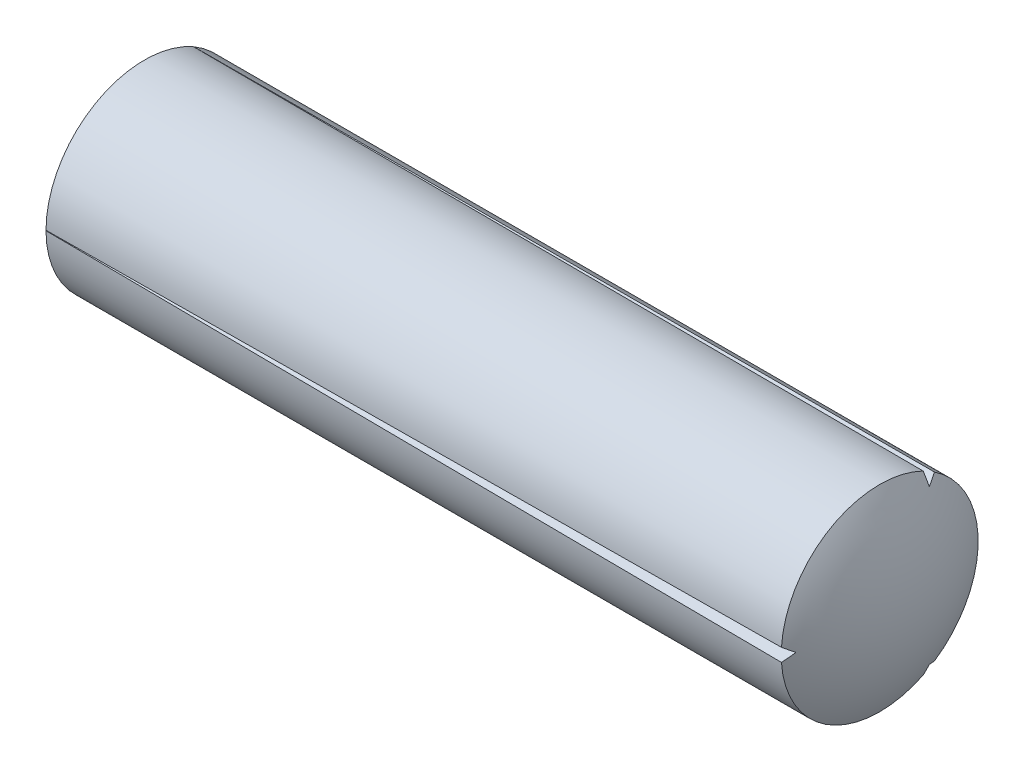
ISO-10303-21;
HEADER;
FILE_DESCRIPTION(('STEP AP214'),'2;1');
FILE_NAME('part.step','',(''),(''),'','','');
FILE_SCHEMA(('AUTOMOTIVE_DESIGN { 1 0 10303 214 1 1 1 1 }'));
ENDSEC;
DATA;
#1=APPLICATION_CONTEXT('core data for automotive mechanical design processes');
#2=APPLICATION_PROTOCOL_DEFINITION('international standard','automotive_design',2000,#1);
#3=PRODUCT_CONTEXT('',#1,'mechanical');
#4=PRODUCT('Part','Part','',(#3));
#5=PRODUCT_RELATED_PRODUCT_CATEGORY('part','',(#4));
#6=PRODUCT_DEFINITION_FORMATION('','',#4);
#7=PRODUCT_DEFINITION_CONTEXT('part definition',#1,'design');
#8=PRODUCT_DEFINITION('design','',#6,#7);
#9=PRODUCT_DEFINITION_SHAPE('','',#8);
#10=(LENGTH_UNIT() NAMED_UNIT(*) SI_UNIT(.MILLI.,.METRE.));
#11=(NAMED_UNIT(*) PLANE_ANGLE_UNIT() SI_UNIT($,.RADIAN.));
#12=(NAMED_UNIT(*) SI_UNIT($,.STERADIAN.) SOLID_ANGLE_UNIT());
#13=UNCERTAINTY_MEASURE_WITH_UNIT(LENGTH_MEASURE(1.E-05),#10,'distance_accuracy_value','');
#14=(GEOMETRIC_REPRESENTATION_CONTEXT(3) GLOBAL_UNCERTAINTY_ASSIGNED_CONTEXT((#13)) GLOBAL_UNIT_ASSIGNED_CONTEXT((#10,
#11,#12)) REPRESENTATION_CONTEXT('',''));
#15=CARTESIAN_POINT('',(0.,0.,0.));
#16=DIRECTION('',(0.,0.,1.));
#17=DIRECTION('',(1.,0.,0.));
#18=AXIS2_PLACEMENT_3D('',#15,#16,#17);
#19=CARTESIAN_POINT('',(-40.,0.,0.));
#20=DIRECTION('',(-1.,0.,0.));
#21=DIRECTION('',(0.,0.,1.));
#22=AXIS2_PLACEMENT_3D('',#19,#20,#21);
#23=CYLINDRICAL_SURFACE('',#22,12.5);
#24=CARTESIAN_POINT('',(-3.34936490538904,0.,0.));
#25=DIRECTION('',(-1.,0.,0.));
#26=DIRECTION('',(0.,0.,1.));
#27=AXIS2_PLACEMENT_3D('',#24,#25,#26);
#28=CIRCLE('',#27,12.5);
#29=CARTESIAN_POINT('',(-3.34936490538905,0.826777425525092,12.4726275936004));
#30=VERTEX_POINT('',#29);
#31=CARTESIAN_POINT('',(-3.34936490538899,11.2150010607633,-5.52030354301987));
#32=VERTEX_POINT('',#31);
#33=EDGE_CURVE('E129',#30,#32,#28,.T.);
#34=ORIENTED_EDGE('',*,*,#33,.T.);
#35=CARTESIAN_POINT('',(900.,0.,0.));
#36=DIRECTION('',(-0.00716952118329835,-0.0871535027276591,0.996169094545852));
#37=DIRECTION('',(-0.999974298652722,0.000624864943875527,-0.00714223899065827));
#38=AXIS2_PLACEMENT_3D('',#35,#36,#37);
#39=ELLIPSE('',#38,1743.49160570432,12.5);
#40=CARTESIAN_POINT('',(-96.6819046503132,10.8397975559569,-6.22485252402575));
#41=VERTEX_POINT('',#40);
#42=EDGE_CURVE('E166',#32,#41,#39,.T.);
#43=ORIENTED_EDGE('',*,*,#42,.T.);
#44=CARTESIAN_POINT('',(-96.6819046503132,0.,0.));
#45=DIRECTION('',(-1.,0.,0.));
#46=DIRECTION('',(0.,0.,1.));
#47=AXIS2_PLACEMENT_3D('',#44,#45,#46);
#48=CIRCLE('',#47,12.5);
#49=CARTESIAN_POINT('',(-96.6819046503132,0.0290183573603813,12.4999663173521));
#50=VERTEX_POINT('',#49);
#51=EDGE_CURVE('E118',#50,#41,#48,.T.);
#52=ORIENTED_EDGE('',*,*,#51,.F.);
#53=CARTESIAN_POINT('',(899.999999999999,0.,0.));
#54=DIRECTION('',(-0.00716952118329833,0.819130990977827,-0.573561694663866));
#55=DIRECTION('',(-0.999974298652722,-0.00587292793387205,0.0041122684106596));
#56=AXIS2_PLACEMENT_3D('',#53,#54,#55);
#57=ELLIPSE('',#56,1743.49160570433,12.5);
#58=EDGE_CURVE('E147',#50,#30,#57,.T.);
#59=ORIENTED_EDGE('',*,*,#58,.T.);
#60=EDGE_LOOP('',(#34,#43,#52,#59));
#61=FACE_BOUND('',#60,.T.);
#62=ADVANCED_FACE('F32',(#61),#23,.T.);
#63=CARTESIAN_POINT('',(-96.6819046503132,10.8107791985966,-6.27511379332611));
#64=VERTEX_POINT('',#63);
#65=CARTESIAN_POINT('',(-96.6819046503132,-10.8107791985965,-6.27511379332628));
#66=VERTEX_POINT('',#65);
#67=EDGE_CURVE('E124',#64,#66,#48,.T.);
#68=ORIENTED_EDGE('',*,*,#67,.F.);
#69=CARTESIAN_POINT('',(899.999999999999,0.,0.));
#70=DIRECTION('',(-0.00716952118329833,-0.906284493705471,-0.422607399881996));
#71=DIRECTION('',(-0.999974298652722,0.00649779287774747,0.00302997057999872));
#72=AXIS2_PLACEMENT_3D('',#69,#70,#71);
#73=ELLIPSE('',#72,1743.49160570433,12.5);
#74=CARTESIAN_POINT('',(-3.3493649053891,10.3882236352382,-6.95232405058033));
#75=VERTEX_POINT('',#74);
#76=EDGE_CURVE('E47',#64,#75,#73,.T.);
#77=ORIENTED_EDGE('',*,*,#76,.T.);
#78=CARTESIAN_POINT('',(-3.34936490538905,-10.3882236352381,-6.95232405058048));
#79=VERTEX_POINT('',#78);
#80=EDGE_CURVE('E127',#75,#79,#28,.T.);
#81=ORIENTED_EDGE('',*,*,#80,.T.);
#82=CARTESIAN_POINT('',(900.,0.,0.));
#83=DIRECTION('',(-0.00716952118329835,0.906284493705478,-0.422607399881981));
#84=DIRECTION('',(-0.999974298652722,-0.00649779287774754,0.00302997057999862));
#85=AXIS2_PLACEMENT_3D('',#82,#83,#84);
#86=ELLIPSE('',#85,1743.49160570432,12.5);
#87=EDGE_CURVE('E155',#79,#66,#86,.T.);
#88=ORIENTED_EDGE('',*,*,#87,.T.);
#89=EDGE_LOOP('',(#68,#77,#81,#88));
#90=FACE_BOUND('',#89,.T.);
#91=ADVANCED_FACE('F172',(#90),#23,.T.);
#92=CARTESIAN_POINT('',(-25.,0.,0.));
#93=DIRECTION('',(-1.,0.,0.));
#94=DIRECTION('',(0.,1.,0.));
#95=AXIS2_PLACEMENT_3D('',#92,#93,#94);
#96=SPHERICAL_SURFACE('',#95,25.);
#97=CARTESIAN_POINT('',(-24.9524531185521,6.01030393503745,2.80265075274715));
#98=DIRECTION('',(-0.00716952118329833,-0.906284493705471,-0.422607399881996));
#99=DIRECTION('',(0.,0.422618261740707,-0.906307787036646));
#100=AXIS2_PLACEMENT_3D('',#97,#98,#99);
#101=CIRCLE('',#100,24.1043385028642);
#102=CARTESIAN_POINT('',(-2.69126967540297,9.77191964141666,-5.64182043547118));
#103=VERTEX_POINT('',#102);
#104=EDGE_CURVE('E168',#75,#103,#101,.T.);
#105=ORIENTED_EDGE('',*,*,#104,.T.);
#106=CARTESIAN_POINT('',(-24.9524531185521,0.577985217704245,-6.60640126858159));
#107=DIRECTION('',(-0.00716952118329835,-0.0871535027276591,0.996169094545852));
#108=DIRECTION('',(0.,-0.996194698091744,-0.0871557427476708));
#109=AXIS2_PLACEMENT_3D('',#106,#107,#108);
#110=CIRCLE('',#109,24.1043385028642);
#111=EDGE_CURVE('E112',#103,#32,#110,.T.);
#112=ORIENTED_EDGE('',*,*,#111,.T.);
#113=ORIENTED_EDGE('',*,*,#33,.F.);
#114=CARTESIAN_POINT('',(-24.9524531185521,-5.43231871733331,3.80375051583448));
#115=DIRECTION('',(-0.00716952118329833,0.819130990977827,-0.573561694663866));
#116=DIRECTION('',(0.,0.573576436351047,0.819152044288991));
#117=AXIS2_PLACEMENT_3D('',#114,#115,#116);
#118=CIRCLE('',#117,24.1043385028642);
#119=CARTESIAN_POINT('',(-2.69126967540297,0.,11.2836408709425));
#120=VERTEX_POINT('',#119);
#121=EDGE_CURVE('E144',#30,#120,#118,.T.);
#122=ORIENTED_EDGE('',*,*,#121,.T.);
#123=CARTESIAN_POINT('',(-24.9524531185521,5.4323187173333,3.80375051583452));
#124=DIRECTION('',(-0.00716952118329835,-0.819130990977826,-0.573561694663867));
#125=DIRECTION('',(0.,0.573576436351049,-0.81915204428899));
#126=AXIS2_PLACEMENT_3D('',#123,#124,#125);
#127=CIRCLE('',#126,24.1043385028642);
#128=CARTESIAN_POINT('',(-3.34936490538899,-0.826777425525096,12.4726275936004));
#129=VERTEX_POINT('',#128);
#130=EDGE_CURVE('E135',#120,#129,#127,.T.);
#131=ORIENTED_EDGE('',*,*,#130,.T.);
#132=CARTESIAN_POINT('',(-3.34936490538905,-11.2150010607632,-5.52030354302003));
#133=VERTEX_POINT('',#132);
#134=EDGE_CURVE('E123',#133,#129,#28,.T.);
#135=ORIENTED_EDGE('',*,*,#134,.F.);
#136=CARTESIAN_POINT('',(-24.9524531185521,-0.57798521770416,-6.60640126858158));
#137=DIRECTION('',(-0.00716952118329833,0.087153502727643,0.996169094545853));
#138=DIRECTION('',(0.,-0.996194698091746,0.0871557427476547));
#139=AXIS2_PLACEMENT_3D('',#136,#137,#138);
#140=CIRCLE('',#139,24.1043385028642);
#141=CARTESIAN_POINT('',(-2.69126967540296,-9.77191964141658,-5.64182043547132));
#142=VERTEX_POINT('',#141);
#143=EDGE_CURVE('E158',#133,#142,#140,.T.);
#144=ORIENTED_EDGE('',*,*,#143,.T.);
#145=CARTESIAN_POINT('',(-24.9524531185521,-6.01030393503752,2.80265075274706));
#146=DIRECTION('',(-0.00716952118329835,0.906284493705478,-0.422607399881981));
#147=DIRECTION('',(0.,0.422618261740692,0.906307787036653));
#148=AXIS2_PLACEMENT_3D('',#145,#146,#147);
#149=CIRCLE('',#148,24.1043385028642);
#150=EDGE_CURVE('E152',#142,#79,#149,.T.);
#151=ORIENTED_EDGE('',*,*,#150,.T.);
#152=ORIENTED_EDGE('',*,*,#80,.F.);
#153=EDGE_LOOP('',(#105,#112,#113,#122,#131,#135,#144,#151,#152));
#154=FACE_BOUND('',#153,.T.);
#155=ADVANCED_FACE('F34',(#154),#96,.T.);
#156=CARTESIAN_POINT('',(-96.6819046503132,-10.8397975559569,-6.2248525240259));
#157=VERTEX_POINT('',#156);
#158=CARTESIAN_POINT('',(-96.6819046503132,-0.0290183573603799,12.4999663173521));
#159=VERTEX_POINT('',#158);
#160=EDGE_CURVE('E126',#157,#159,#48,.T.);
#161=ORIENTED_EDGE('',*,*,#160,.F.);
#162=CARTESIAN_POINT('',(899.999999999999,0.,0.));
#163=DIRECTION('',(-0.00716952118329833,0.087153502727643,0.996169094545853));
#164=DIRECTION('',(-0.999974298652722,-0.00062486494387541,-0.00714223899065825));
#165=AXIS2_PLACEMENT_3D('',#162,#163,#164);
#166=ELLIPSE('',#165,1743.49160570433,12.5);
#167=EDGE_CURVE('E55',#157,#133,#166,.T.);
#168=ORIENTED_EDGE('',*,*,#167,.T.);
#169=ORIENTED_EDGE('',*,*,#134,.T.);
#170=CARTESIAN_POINT('',(899.999999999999,0.,0.));
#171=DIRECTION('',(-0.00716952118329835,-0.819130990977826,-0.573561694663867));
#172=DIRECTION('',(-0.999974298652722,0.00587292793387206,0.00411226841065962));
#173=AXIS2_PLACEMENT_3D('',#170,#171,#172);
#174=ELLIPSE('',#173,1743.49160570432,12.5);
#175=EDGE_CURVE('E139',#129,#159,#174,.T.);
#176=ORIENTED_EDGE('',*,*,#175,.T.);
#177=EDGE_LOOP('',(#161,#168,#169,#176));
#178=FACE_BOUND('',#177,.T.);
#179=ADVANCED_FACE('F191',(#178),#23,.T.);
#180=CARTESIAN_POINT('',(-75.0312695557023,0.,0.));
#181=DIRECTION('',(-1.,0.,0.));
#182=DIRECTION('',(0.,1.,0.));
#183=AXIS2_PLACEMENT_3D('',#180,#181,#182);
#184=SPHERICAL_SURFACE('',#183,25.);
#185=CARTESIAN_POINT('',(-100.,0.,0.));
#186=DIRECTION('',(-1.,0.,0.));
#187=DIRECTION('',(0.,0.,1.));
#188=AXIS2_PLACEMENT_3D('',#185,#186,#187);
#189=CIRCLE('',#188,1.25);
#190=CARTESIAN_POINT('',(-100.,0.,1.25));
#191=VERTEX_POINT('',#190);
#192=EDGE_CURVE('E131',#191,#191,#189,.T.);
#193=ORIENTED_EDGE('',*,*,#192,.F.);
#194=EDGE_LOOP('',(#193));
#195=FACE_BOUND('',#194,.T.);
#196=ORIENTED_EDGE('',*,*,#51,.T.);
#197=CARTESIAN_POINT('',(-74.9811509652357,0.609247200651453,-6.96372736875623));
#198=DIRECTION('',(-0.00716952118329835,-0.0871535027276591,0.996169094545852));
#199=DIRECTION('',(0.,-0.996194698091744,-0.0871557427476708));
#200=AXIS2_PLACEMENT_3D('',#197,#198,#199);
#201=CIRCLE('',#200,24.002766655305);
#202=CARTESIAN_POINT('',(-96.7056275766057,10.7896549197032,-6.22941017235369));
#203=VERTEX_POINT('',#202);
#204=EDGE_CURVE('E11',#41,#203,#201,.T.);
#205=ORIENTED_EDGE('',*,*,#204,.T.);
#206=CARTESIAN_POINT('',(-74.9811509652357,6.33538840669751,2.95424013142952));
#207=DIRECTION('',(-0.00716952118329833,-0.906284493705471,-0.422607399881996));
#208=DIRECTION('',(0.,0.422618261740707,-0.906307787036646));
#209=AXIS2_PLACEMENT_3D('',#206,#207,#208);
#210=CIRCLE('',#209,24.002766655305);
#211=EDGE_CURVE('E40',#203,#64,#210,.T.);
#212=ORIENTED_EDGE('',*,*,#211,.T.);
#213=ORIENTED_EDGE('',*,*,#67,.T.);
#214=CARTESIAN_POINT('',(-74.9811509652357,-6.33538840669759,2.95424013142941));
#215=DIRECTION('',(-0.00716952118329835,0.906284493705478,-0.422607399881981));
#216=DIRECTION('',(0.,0.422618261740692,0.906307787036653));
#217=AXIS2_PLACEMENT_3D('',#214,#215,#216);
#218=CIRCLE('',#217,24.002766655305);
#219=CARTESIAN_POINT('',(-96.7056275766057,-10.7896549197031,-6.22941017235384));
#220=VERTEX_POINT('',#219);
#221=EDGE_CURVE('E107',#66,#220,#218,.T.);
#222=ORIENTED_EDGE('',*,*,#221,.T.);
#223=CARTESIAN_POINT('',(-74.9811509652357,-0.609247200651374,-6.96372736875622));
#224=DIRECTION('',(-0.00716952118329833,0.087153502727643,0.996169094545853));
#225=DIRECTION('',(0.,-0.996194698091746,0.0871557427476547));
#226=AXIS2_PLACEMENT_3D('',#223,#224,#225);
#227=CIRCLE('',#226,24.002766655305);
#228=EDGE_CURVE('E180',#220,#157,#227,.T.);
#229=ORIENTED_EDGE('',*,*,#228,.T.);
#230=ORIENTED_EDGE('',*,*,#160,.T.);
#231=CARTESIAN_POINT('',(-74.9811509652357,5.72614120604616,4.0094872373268));
#232=DIRECTION('',(-0.00716952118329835,-0.819130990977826,-0.573561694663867));
#233=DIRECTION('',(0.,0.573576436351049,-0.81915204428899));
#234=AXIS2_PLACEMENT_3D('',#231,#232,#233);
#235=CIRCLE('',#234,24.002766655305);
#236=CARTESIAN_POINT('',(-96.7056275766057,0.,12.4588203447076));
#237=VERTEX_POINT('',#236);
#238=EDGE_CURVE('E178',#159,#237,#235,.T.);
#239=ORIENTED_EDGE('',*,*,#238,.T.);
#240=CARTESIAN_POINT('',(-74.9811509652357,-5.72614120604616,4.00948723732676));
#241=DIRECTION('',(-0.00716952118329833,0.819130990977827,-0.573561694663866));
#242=DIRECTION('',(0.,0.573576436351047,0.819152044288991));
#243=AXIS2_PLACEMENT_3D('',#240,#241,#242);
#244=CIRCLE('',#243,24.002766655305);
#245=EDGE_CURVE('E120',#237,#50,#244,.T.);
#246=ORIENTED_EDGE('',*,*,#245,.T.);
#247=EDGE_LOOP('',(#196,#205,#212,#213,#222,#229,#230,#239,#246));
#248=FACE_BOUND('',#247,.T.);
#249=ADVANCED_FACE('F115',(#195,#248),#184,.T.);
#250=CARTESIAN_POINT('',(-100.,0.,0.));
#251=DIRECTION('',(1.,0.,0.));
#252=DIRECTION('',(0.,0.,-1.));
#253=AXIS2_PLACEMENT_3D('',#250,#251,#252);
#254=PLANE('',#253);
#255=ORIENTED_EDGE('',*,*,#192,.T.);
#256=EDGE_LOOP('',(#255));
#257=FACE_BOUND('',#256,.T.);
#258=ADVANCED_FACE('F208',(#257),#254,.F.);
#259=CARTESIAN_POINT('',(-100.,0.,12.5));
#260=DIRECTION('',(-0.00716952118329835,-0.819130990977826,-0.573561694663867));
#261=DIRECTION('',(0.,0.573576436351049,-0.81915204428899));
#262=AXIS2_PLACEMENT_3D('',#259,#260,#261);
#263=PLANE('',#262);
#264=DIRECTION('',(0.999921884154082,0.,-0.012499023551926));
#265=VECTOR('',#264,1.);
#266=CARTESIAN_POINT('',(-100.,0.,12.5));
#267=LINE('',#266,#265);
#268=EDGE_CURVE('E149',#237,#120,#267,.T.);
#269=ORIENTED_EDGE('',*,*,#268,.F.);
#270=ORIENTED_EDGE('',*,*,#238,.F.);
#271=ORIENTED_EDGE('',*,*,#175,.F.);
#272=ORIENTED_EDGE('',*,*,#130,.F.);
#273=EDGE_LOOP('',(#269,#270,#271,#272));
#274=FACE_BOUND('',#273,.T.);
#275=ADVANCED_FACE('F194',(#274),#263,.F.);
#276=CARTESIAN_POINT('',(-100.,0.,12.5));
#277=DIRECTION('',(-0.00716952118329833,0.819130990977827,-0.573561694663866));
#278=DIRECTION('',(0.,0.573576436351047,0.819152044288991));
#279=AXIS2_PLACEMENT_3D('',#276,#277,#278);
#280=PLANE('',#279);
#281=ORIENTED_EDGE('',*,*,#58,.F.);
#282=ORIENTED_EDGE('',*,*,#245,.F.);
#283=ORIENTED_EDGE('',*,*,#268,.T.);
#284=ORIENTED_EDGE('',*,*,#121,.F.);
#285=EDGE_LOOP('',(#281,#282,#283,#284));
#286=FACE_BOUND('',#285,.T.);
#287=ADVANCED_FACE('F196',(#286),#280,.F.);
#288=CARTESIAN_POINT('',(-100.,-10.8253175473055,-6.25000000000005));
#289=DIRECTION('',(-0.00716952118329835,0.906284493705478,-0.422607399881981));
#290=DIRECTION('',(0.,0.422618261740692,0.906307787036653));
#291=AXIS2_PLACEMENT_3D('',#288,#289,#290);
#292=PLANE('',#291);
#293=DIRECTION('',(0.999921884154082,0.0108244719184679,0.00624951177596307));
#294=VECTOR('',#293,1.);
#295=CARTESIAN_POINT('',(-100.,-10.8253175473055,-6.25000000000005));
#296=LINE('',#295,#294);
#297=EDGE_CURVE('E162',#220,#142,#296,.T.);
#298=ORIENTED_EDGE('',*,*,#297,.F.);
#299=ORIENTED_EDGE('',*,*,#221,.F.);
#300=ORIENTED_EDGE('',*,*,#87,.F.);
#301=ORIENTED_EDGE('',*,*,#150,.F.);
#302=EDGE_LOOP('',(#298,#299,#300,#301));
#303=FACE_BOUND('',#302,.T.);
#304=ADVANCED_FACE('F186',(#303),#292,.F.);
#305=CARTESIAN_POINT('',(-100.,-10.8253175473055,-6.25000000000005));
#306=DIRECTION('',(-0.00716952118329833,0.087153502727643,0.996169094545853));
#307=DIRECTION('',(0.,-0.996194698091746,0.0871557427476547));
#308=AXIS2_PLACEMENT_3D('',#305,#306,#307);
#309=PLANE('',#308);
#310=ORIENTED_EDGE('',*,*,#167,.F.);
#311=ORIENTED_EDGE('',*,*,#228,.F.);
#312=ORIENTED_EDGE('',*,*,#297,.T.);
#313=ORIENTED_EDGE('',*,*,#143,.F.);
#314=EDGE_LOOP('',(#310,#311,#312,#313));
#315=FACE_BOUND('',#314,.T.);
#316=ADVANCED_FACE('F187',(#315),#309,.F.);
#317=CARTESIAN_POINT('',(-100.,10.8253175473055,-6.2499999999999));
#318=DIRECTION('',(-0.00716952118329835,-0.0871535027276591,0.996169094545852));
#319=DIRECTION('',(0.,-0.996194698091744,-0.0871557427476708));
#320=AXIS2_PLACEMENT_3D('',#317,#318,#319);
#321=PLANE('',#320);
#322=DIRECTION('',(0.999921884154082,-0.010824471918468,0.00624951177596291));
#323=VECTOR('',#322,1.);
#324=CARTESIAN_POINT('',(-100.,10.8253175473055,-6.2499999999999));
#325=LINE('',#324,#323);
#326=EDGE_CURVE('E103',#203,#103,#325,.T.);
#327=ORIENTED_EDGE('',*,*,#326,.F.);
#328=ORIENTED_EDGE('',*,*,#204,.F.);
#329=ORIENTED_EDGE('',*,*,#42,.F.);
#330=ORIENTED_EDGE('',*,*,#111,.F.);
#331=EDGE_LOOP('',(#327,#328,#329,#330));
#332=FACE_BOUND('',#331,.T.);
#333=ADVANCED_FACE('F109',(#332),#321,.F.);
#334=CARTESIAN_POINT('',(-100.,10.8253175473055,-6.2499999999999));
#335=DIRECTION('',(-0.00716952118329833,-0.906284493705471,-0.422607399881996));
#336=DIRECTION('',(0.,0.422618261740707,-0.906307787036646));
#337=AXIS2_PLACEMENT_3D('',#334,#335,#336);
#338=PLANE('',#337);
#339=ORIENTED_EDGE('',*,*,#76,.F.);
#340=ORIENTED_EDGE('',*,*,#211,.F.);
#341=ORIENTED_EDGE('',*,*,#326,.T.);
#342=ORIENTED_EDGE('',*,*,#104,.F.);
#343=EDGE_LOOP('',(#339,#340,#341,#342));
#344=FACE_BOUND('',#343,.T.);
#345=ADVANCED_FACE('F102',(#344),#338,.F.);
#346=CLOSED_SHELL('',(#62,#91,#155,#179,#249,#258,#275,#287,#304,#316,#333,#345));
#347=MANIFOLD_SOLID_BREP('B2',#346);
#348=ADVANCED_BREP_SHAPE_REPRESENTATION('',(#18,#347),#14);
#349=SHAPE_DEFINITION_REPRESENTATION(#9,#348);
ENDSEC;
END-ISO-10303-21;
